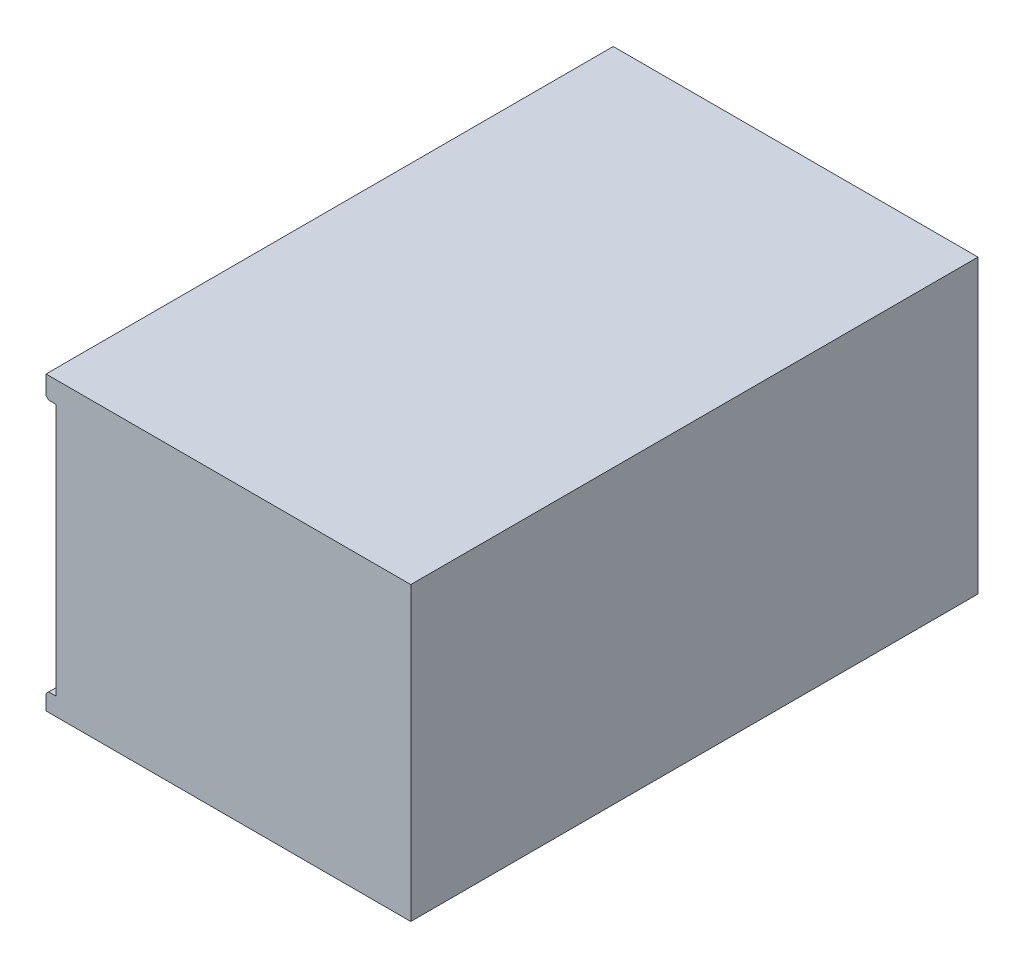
from build123d import *

# Parameters (mm, degrees)
EXTRUDE1_DEPTH                   = 40.4876
F_10_32_TAPPED_HOLE1_D           = 4.0386
F_10_32_TAPPED_HOLE1_DEPTH       = 9.99744
F_10_32_TAPPED_HOLE1_CBORE_D     = 4.826
F_10_32_TAPPED_HOLE1_CBORE_DEPTH = 7.62
F_10_32_TAPPED_HOLE1_TIP         = 1.213317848
CHAMFER1_SIZE                    = 0.381


with BuildPart() as part:
    # Sketch1 → Extrude1 (new, symmetric)
    with BuildSketch(Plane.XY):
        Polygon((50.673, 0), (50.673, -41.656), (-1.397, -41.656), (-1.397, -39.116), (0, -39.116), (0, -3.048), (-1.397, -3.048), (-1.397, 0), align=None)
    extrude(amount=EXTRUDE1_DEPTH, both=True)

    # 10-32 Tapped Hole1
    with Locations(Plane(origin=(0, -6.35, -35.179), x_dir=(0, 0, -1), z_dir=(-1, 0, 0))):
        with Locations((0, 0), (-70.358, 0), (0, 29.464), (-70.358, 29.464)):
            CounterBoreHole(F_10_32_TAPPED_HOLE1_D / 2, F_10_32_TAPPED_HOLE1_CBORE_D / 2, F_10_32_TAPPED_HOLE1_CBORE_DEPTH, depth=F_10_32_TAPPED_HOLE1_DEPTH)
            with Locations((0, 0, -(F_10_32_TAPPED_HOLE1_DEPTH + F_10_32_TAPPED_HOLE1_TIP / 2))):  # 118° drill point
                Cone(0, F_10_32_TAPPED_HOLE1_D / 2, F_10_32_TAPPED_HOLE1_TIP, mode=Mode.SUBTRACT)

    # Chamfer1
    chamfer1_edges = [part.edges().sort_by_distance(p)[0] for p in [
        (-1.397, -39.116, 0),
        (-1.397, -3.048, 0),
    ]]
    chamfer(chamfer1_edges, length=CHAMFER1_SIZE)


solid = part.part
